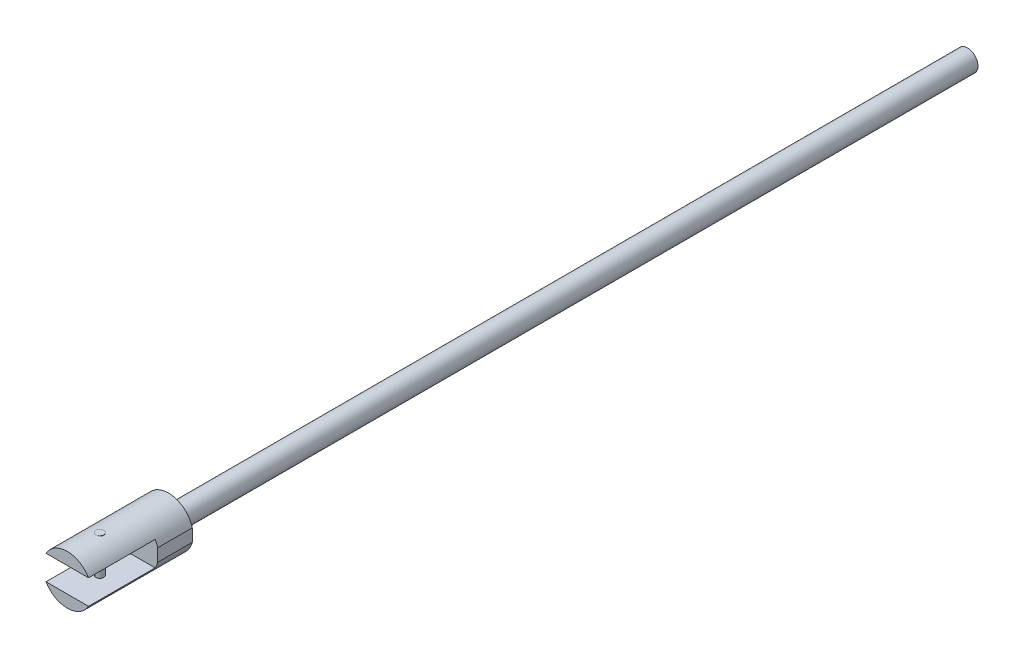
from build123d import *

# Parameters (mm, degrees)
SKETCH1_R           = 2
BOSS_EXTRUDE1_DEPTH = 152.4
SKETCH2_W           = 9.068360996
SKETCH2_H           = 9.379909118
BOSS_EXTRUDE2_DEPTH = 6.604
SKETCH3_W           = 9.068360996
SKETCH3_H           = 2.338852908
BOSS_EXTRUDE3_DEPTH = 12.7
SKETCH5_OUTSIDE_W   = 45.508
SKETCH5_OUTSIDE_H   = 45.82
SKETCH5_OUTSIDE_R   = 4.689954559
CUT_EXTRUDE2_DEPTH  = 172.827873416
BOSS_EXTRUDE4_REACH = 174.02
SKETCH4_R           = 0.75


with BuildPart() as part:
    # Sketch1 → Boss-Extrude1 (new body)
    with BuildSketch(Plane.XY):
        with Locations(Location((0, 0, 0), (0, 0, 180))):
            Circle(SKETCH1_R)
    extrude(amount=BOSS_EXTRUDE1_DEPTH)

    # Sketch2 → Boss-Extrude2 (add)
    with BuildSketch(Plane.XY.offset(152.4)):
        Rectangle(SKETCH2_W, SKETCH2_H)
    extrude(amount=BOSS_EXTRUDE2_DEPTH)

    # Sketch3 → Boss-Extrude3 (add)
    with BuildSketch(Plane.XY.offset(159.004)):
        with Locations((0, 3.520528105)):
            Rectangle(SKETCH3_W, SKETCH3_H)
    boss_extrude3 = extrude(amount=BOSS_EXTRUDE3_DEPTH)

    # Mirror1: Boss-Extrude3 across plane
    add(boss_extrude3.mirror(Plane.ZX))

    # Sketch5 outside → Cut-Extrude2 (cut, through all)
    with BuildSketch(Plane.XY.offset(171.704)):
        Rectangle(SKETCH5_OUTSIDE_W, SKETCH5_OUTSIDE_H)
        Circle(SKETCH5_OUTSIDE_R, mode=Mode.SUBTRACT)
    extrude(amount=-CUT_EXTRUDE2_DEPTH, mode=Mode.SUBTRACT)

    # Sketch4 → Boss-Extrude4 (add, up to next)
    with BuildSketch(Plane(origin=(0, 4.689954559, 0), x_dir=(1, 0, 0), z_dir=(0, 1, 0)), mode=Mode.PRIVATE) as boss_extrude4_sk1:
        with Locations(Location((0, -165.487002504, 0), (0, 0, 270))):
            Circle(SKETCH4_R)
    boss_extrude4_tool1 = extrude(boss_extrude4_sk1.sketch, amount=-BOSS_EXTRUDE4_REACH, mode=Mode.PRIVATE) - part.part
    add(boss_extrude4_tool1.solids().sort_by_distance((0, 4.689955, 165.487003))[0])
    add(boss_extrude4_tool1.solids().sort_by_distance((0, 4.689955, 165.487003))[1])
    add(boss_extrude4_tool1.solids().sort_by_distance((0, 4.689955, 165.487003))[2])


solid = part.part
